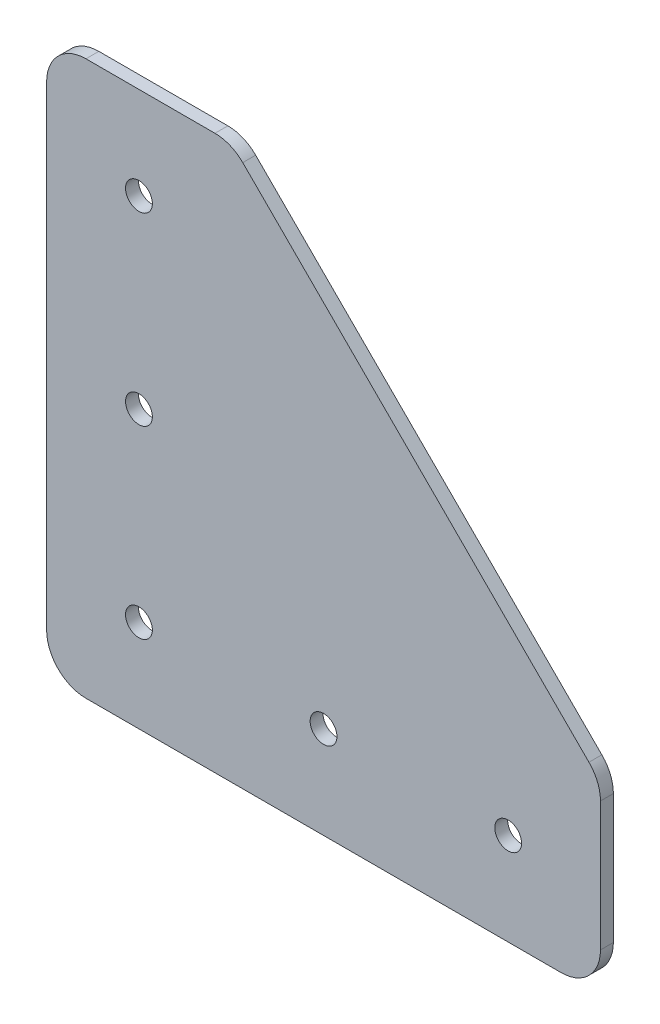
ISO-10303-21;
HEADER;
FILE_DESCRIPTION(('STEP AP214'),'2;1');
FILE_NAME('part.step','',(''),(''),'','','');
FILE_SCHEMA(('AUTOMOTIVE_DESIGN { 1 0 10303 214 1 1 1 1 }'));
ENDSEC;
DATA;
#1=APPLICATION_CONTEXT('core data for automotive mechanical design processes');
#2=APPLICATION_PROTOCOL_DEFINITION('international standard','automotive_design',2000,#1);
#3=PRODUCT_CONTEXT('',#1,'mechanical');
#4=PRODUCT('Part','Part','',(#3));
#5=PRODUCT_RELATED_PRODUCT_CATEGORY('part','',(#4));
#6=PRODUCT_DEFINITION_FORMATION('','',#4);
#7=PRODUCT_DEFINITION_CONTEXT('part definition',#1,'design');
#8=PRODUCT_DEFINITION('design','',#6,#7);
#9=PRODUCT_DEFINITION_SHAPE('','',#8);
#10=(LENGTH_UNIT() NAMED_UNIT(*) SI_UNIT(.MILLI.,.METRE.));
#11=(NAMED_UNIT(*) PLANE_ANGLE_UNIT() SI_UNIT($,.RADIAN.));
#12=(NAMED_UNIT(*) SI_UNIT($,.STERADIAN.) SOLID_ANGLE_UNIT());
#13=UNCERTAINTY_MEASURE_WITH_UNIT(LENGTH_MEASURE(1.E-05),#10,'distance_accuracy_value','');
#14=(GEOMETRIC_REPRESENTATION_CONTEXT(3) GLOBAL_UNCERTAINTY_ASSIGNED_CONTEXT((#13)) GLOBAL_UNIT_ASSIGNED_CONTEXT((#10,
#11,#12)) REPRESENTATION_CONTEXT('',''));
#15=CARTESIAN_POINT('',(0.,0.,0.));
#16=DIRECTION('',(0.,0.,1.));
#17=DIRECTION('',(1.,0.,0.));
#18=AXIS2_PLACEMENT_3D('',#15,#16,#17);
#19=CARTESIAN_POINT('',(0.,0.,0.));
#20=DIRECTION('',(0.,0.,1.));
#21=DIRECTION('',(1.,0.,0.));
#22=AXIS2_PLACEMENT_3D('',#19,#20,#21);
#23=PLANE('',#22);
#24=CARTESIAN_POINT('',(4.841875,4.841875,0.));
#25=DIRECTION('',(0.,0.,-1.));
#26=DIRECTION('',(-1.,0.,0.));
#27=AXIS2_PLACEMENT_3D('',#24,#25,#26);
#28=CIRCLE('',#27,4.841875);
#29=CARTESIAN_POINT('',(0.,4.841875,0.));
#30=VERTEX_POINT('',#29);
#31=CARTESIAN_POINT('',(4.841875,0.,0.));
#32=VERTEX_POINT('',#31);
#33=EDGE_CURVE('E98',#30,#32,#28,.F.);
#34=ORIENTED_EDGE('',*,*,#33,.F.);
#35=DIRECTION('',(0.,1.,0.));
#36=VECTOR('',#35,1.);
#37=CARTESIAN_POINT('',(0.,68.199,0.));
#38=LINE('',#37,#36);
#39=CARTESIAN_POINT('',(0.,63.357125,0.));
#40=VERTEX_POINT('',#39);
#41=EDGE_CURVE('E90',#30,#40,#38,.T.);
#42=ORIENTED_EDGE('',*,*,#41,.T.);
#43=CARTESIAN_POINT('',(4.84187500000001,63.357125,0.));
#44=DIRECTION('',(0.,0.,-1.));
#45=DIRECTION('',(-1.,0.,0.));
#46=AXIS2_PLACEMENT_3D('',#43,#44,#45);
#47=CIRCLE('',#46,4.841875);
#48=CARTESIAN_POINT('',(4.84187500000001,68.199,0.));
#49=VERTEX_POINT('',#48);
#50=EDGE_CURVE('E166',#49,#40,#47,.F.);
#51=ORIENTED_EDGE('',*,*,#50,.F.);
#52=DIRECTION('',(1.,0.,0.));
#53=VECTOR('',#52,1.);
#54=CARTESIAN_POINT('',(22.733,68.199,0.));
#55=LINE('',#54,#53);
#56=CARTESIAN_POINT('',(20.7274297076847,68.199,0.));
#57=VERTEX_POINT('',#56);
#58=EDGE_CURVE('E125',#49,#57,#55,.T.);
#59=ORIENTED_EDGE('',*,*,#58,.T.);
#60=CARTESIAN_POINT('',(20.7274297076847,63.357125,0.));
#61=DIRECTION('',(0.,0.,-1.));
#62=DIRECTION('',(-1.,0.,0.));
#63=AXIS2_PLACEMENT_3D('',#60,#61,#62);
#64=CIRCLE('',#63,4.841875);
#65=CARTESIAN_POINT('',(24.1511523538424,66.7808476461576,0.));
#66=VERTEX_POINT('',#65);
#67=EDGE_CURVE('E128',#66,#57,#64,.F.);
#68=ORIENTED_EDGE('',*,*,#67,.F.);
#69=DIRECTION('',(0.707106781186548,-0.707106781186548,0.));
#70=VECTOR('',#69,1.);
#71=CARTESIAN_POINT('',(68.199,22.733,0.));
#72=LINE('',#71,#70);
#73=CARTESIAN_POINT('',(66.7808476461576,24.1511523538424,0.));
#74=VERTEX_POINT('',#73);
#75=EDGE_CURVE('E129',#66,#74,#72,.T.);
#76=ORIENTED_EDGE('',*,*,#75,.T.);
#77=CARTESIAN_POINT('',(63.357125,20.7274297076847,0.));
#78=DIRECTION('',(0.,0.,-1.));
#79=DIRECTION('',(-1.,0.,0.));
#80=AXIS2_PLACEMENT_3D('',#77,#78,#79);
#81=CIRCLE('',#80,4.841875);
#82=CARTESIAN_POINT('',(68.199,20.7274297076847,0.));
#83=VERTEX_POINT('',#82);
#84=EDGE_CURVE('E132',#83,#74,#81,.F.);
#85=ORIENTED_EDGE('',*,*,#84,.F.);
#86=DIRECTION('',(0.,1.,0.));
#87=VECTOR('',#86,1.);
#88=CARTESIAN_POINT('',(68.199,0.,0.));
#89=LINE('',#88,#87);
#90=CARTESIAN_POINT('',(68.199,4.84187499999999,0.));
#91=VERTEX_POINT('',#90);
#92=EDGE_CURVE('E133',#83,#91,#89,.F.);
#93=ORIENTED_EDGE('',*,*,#92,.T.);
#94=CARTESIAN_POINT('',(63.357125,4.84187499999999,0.));
#95=DIRECTION('',(0.,0.,-1.));
#96=DIRECTION('',(-1.,0.,0.));
#97=AXIS2_PLACEMENT_3D('',#94,#95,#96);
#98=CIRCLE('',#97,4.841875);
#99=CARTESIAN_POINT('',(63.357125,0.,0.));
#100=VERTEX_POINT('',#99);
#101=EDGE_CURVE('E101',#100,#91,#98,.F.);
#102=ORIENTED_EDGE('',*,*,#101,.F.);
#103=DIRECTION('',(-1.,0.,0.));
#104=VECTOR('',#103,1.);
#105=CARTESIAN_POINT('',(0.,0.,0.));
#106=LINE('',#105,#104);
#107=EDGE_CURVE('E95',#100,#32,#106,.T.);
#108=ORIENTED_EDGE('',*,*,#107,.T.);
#109=EDGE_LOOP('',(#34,#42,#51,#59,#68,#76,#85,#93,#102,#108));
#110=FACE_BOUND('',#109,.T.);
#111=CARTESIAN_POINT('',(11.3665,56.8325,0.));
#112=DIRECTION('',(0.,0.,1.));
#113=DIRECTION('',(1.,0.,0.));
#114=AXIS2_PLACEMENT_3D('',#111,#112,#113);
#115=CIRCLE('',#114,1.651);
#116=CARTESIAN_POINT('',(13.0175,56.8325,0.));
#117=VERTEX_POINT('',#116);
#118=EDGE_CURVE('E124',#117,#117,#115,.T.);
#119=ORIENTED_EDGE('',*,*,#118,.T.);
#120=EDGE_LOOP('',(#119));
#121=FACE_BOUND('',#120,.T.);
#122=CARTESIAN_POINT('',(11.3665,34.0995,0.));
#123=DIRECTION('',(0.,0.,1.));
#124=DIRECTION('',(1.,0.,0.));
#125=AXIS2_PLACEMENT_3D('',#122,#123,#124);
#126=CIRCLE('',#125,1.651);
#127=CARTESIAN_POINT('',(13.0175,34.0995,0.));
#128=VERTEX_POINT('',#127);
#129=EDGE_CURVE('E178',#128,#128,#126,.T.);
#130=ORIENTED_EDGE('',*,*,#129,.T.);
#131=EDGE_LOOP('',(#130));
#132=FACE_BOUND('',#131,.T.);
#133=CARTESIAN_POINT('',(11.3665,11.3665,0.));
#134=DIRECTION('',(0.,0.,1.));
#135=DIRECTION('',(1.,0.,0.));
#136=AXIS2_PLACEMENT_3D('',#133,#134,#135);
#137=CIRCLE('',#136,1.651);
#138=CARTESIAN_POINT('',(13.0175,11.3665,0.));
#139=VERTEX_POINT('',#138);
#140=EDGE_CURVE('E181',#139,#139,#137,.T.);
#141=ORIENTED_EDGE('',*,*,#140,.T.);
#142=EDGE_LOOP('',(#141));
#143=FACE_BOUND('',#142,.T.);
#144=CARTESIAN_POINT('',(34.0995,11.3665,0.));
#145=DIRECTION('',(0.,0.,1.));
#146=DIRECTION('',(1.,0.,0.));
#147=AXIS2_PLACEMENT_3D('',#144,#145,#146);
#148=CIRCLE('',#147,1.651);
#149=CARTESIAN_POINT('',(35.7505,11.3665,0.));
#150=VERTEX_POINT('',#149);
#151=EDGE_CURVE('E183',#150,#150,#148,.T.);
#152=ORIENTED_EDGE('',*,*,#151,.T.);
#153=EDGE_LOOP('',(#152));
#154=FACE_BOUND('',#153,.T.);
#155=CARTESIAN_POINT('',(56.8325,11.3665,0.));
#156=DIRECTION('',(0.,0.,1.));
#157=DIRECTION('',(1.,0.,0.));
#158=AXIS2_PLACEMENT_3D('',#155,#156,#157);
#159=CIRCLE('',#158,1.651);
#160=CARTESIAN_POINT('',(58.4835,11.3665,0.));
#161=VERTEX_POINT('',#160);
#162=EDGE_CURVE('E20',#161,#161,#159,.T.);
#163=ORIENTED_EDGE('',*,*,#162,.T.);
#164=EDGE_LOOP('',(#163));
#165=FACE_BOUND('',#164,.T.);
#166=ADVANCED_FACE('F17',(#110,#121,#132,#143,#154,#165),#23,.F.);
#167=CARTESIAN_POINT('',(56.8325,11.3665,1.5875));
#168=DIRECTION('',(0.,0.,1.));
#169=DIRECTION('',(1.,0.,0.));
#170=AXIS2_PLACEMENT_3D('',#167,#168,#169);
#171=CYLINDRICAL_SURFACE('',#170,1.651);
#172=CARTESIAN_POINT('',(56.8325,11.3665,1.5875));
#173=DIRECTION('',(0.,0.,1.));
#174=DIRECTION('',(1.,0.,0.));
#175=AXIS2_PLACEMENT_3D('',#172,#173,#174);
#176=CIRCLE('',#175,1.651);
#177=CARTESIAN_POINT('',(58.4835,11.3665,1.5875));
#178=VERTEX_POINT('',#177);
#179=EDGE_CURVE('E162',#178,#178,#176,.F.);
#180=ORIENTED_EDGE('',*,*,#179,.F.);
#181=EDGE_LOOP('',(#180));
#182=FACE_BOUND('',#181,.T.);
#183=ORIENTED_EDGE('',*,*,#162,.F.);
#184=EDGE_LOOP('',(#183));
#185=FACE_BOUND('',#184,.T.);
#186=ADVANCED_FACE('F191',(#182,#185),#171,.F.);
#187=CARTESIAN_POINT('',(34.0995,11.3665,1.5875));
#188=DIRECTION('',(0.,0.,1.));
#189=DIRECTION('',(1.,0.,0.));
#190=AXIS2_PLACEMENT_3D('',#187,#188,#189);
#191=CYLINDRICAL_SURFACE('',#190,1.651);
#192=CARTESIAN_POINT('',(34.0995,11.3665,1.5875));
#193=DIRECTION('',(0.,0.,1.));
#194=DIRECTION('',(1.,0.,0.));
#195=AXIS2_PLACEMENT_3D('',#192,#193,#194);
#196=CIRCLE('',#195,1.651);
#197=CARTESIAN_POINT('',(35.7505,11.3665,1.5875));
#198=VERTEX_POINT('',#197);
#199=EDGE_CURVE('E159',#198,#198,#196,.F.);
#200=ORIENTED_EDGE('',*,*,#199,.F.);
#201=EDGE_LOOP('',(#200));
#202=FACE_BOUND('',#201,.T.);
#203=ORIENTED_EDGE('',*,*,#151,.F.);
#204=EDGE_LOOP('',(#203));
#205=FACE_BOUND('',#204,.T.);
#206=ADVANCED_FACE('F193',(#202,#205),#191,.F.);
#207=CARTESIAN_POINT('',(11.3665,11.3665,1.5875));
#208=DIRECTION('',(0.,0.,1.));
#209=DIRECTION('',(1.,0.,0.));
#210=AXIS2_PLACEMENT_3D('',#207,#208,#209);
#211=CYLINDRICAL_SURFACE('',#210,1.651);
#212=CARTESIAN_POINT('',(11.3665,11.3665,1.5875));
#213=DIRECTION('',(0.,0.,1.));
#214=DIRECTION('',(1.,0.,0.));
#215=AXIS2_PLACEMENT_3D('',#212,#213,#214);
#216=CIRCLE('',#215,1.651);
#217=CARTESIAN_POINT('',(13.0175,11.3665,1.5875));
#218=VERTEX_POINT('',#217);
#219=EDGE_CURVE('E156',#218,#218,#216,.F.);
#220=ORIENTED_EDGE('',*,*,#219,.F.);
#221=EDGE_LOOP('',(#220));
#222=FACE_BOUND('',#221,.T.);
#223=ORIENTED_EDGE('',*,*,#140,.F.);
#224=EDGE_LOOP('',(#223));
#225=FACE_BOUND('',#224,.T.);
#226=ADVANCED_FACE('F200',(#222,#225),#211,.F.);
#227=CARTESIAN_POINT('',(11.3665,34.0995,1.5875));
#228=DIRECTION('',(0.,0.,1.));
#229=DIRECTION('',(1.,0.,0.));
#230=AXIS2_PLACEMENT_3D('',#227,#228,#229);
#231=CYLINDRICAL_SURFACE('',#230,1.651);
#232=CARTESIAN_POINT('',(11.3665,34.0995,1.5875));
#233=DIRECTION('',(0.,0.,1.));
#234=DIRECTION('',(1.,0.,0.));
#235=AXIS2_PLACEMENT_3D('',#232,#233,#234);
#236=CIRCLE('',#235,1.651);
#237=CARTESIAN_POINT('',(13.0175,34.0995,1.5875));
#238=VERTEX_POINT('',#237);
#239=EDGE_CURVE('E153',#238,#238,#236,.F.);
#240=ORIENTED_EDGE('',*,*,#239,.F.);
#241=EDGE_LOOP('',(#240));
#242=FACE_BOUND('',#241,.T.);
#243=ORIENTED_EDGE('',*,*,#129,.F.);
#244=EDGE_LOOP('',(#243));
#245=FACE_BOUND('',#244,.T.);
#246=ADVANCED_FACE('F250',(#242,#245),#231,.F.);
#247=CARTESIAN_POINT('',(11.3665,56.8325,1.5875));
#248=DIRECTION('',(0.,0.,1.));
#249=DIRECTION('',(1.,0.,0.));
#250=AXIS2_PLACEMENT_3D('',#247,#248,#249);
#251=CYLINDRICAL_SURFACE('',#250,1.651);
#252=CARTESIAN_POINT('',(11.3665,56.8325,1.5875));
#253=DIRECTION('',(0.,0.,1.));
#254=DIRECTION('',(1.,0.,0.));
#255=AXIS2_PLACEMENT_3D('',#252,#253,#254);
#256=CIRCLE('',#255,1.651);
#257=CARTESIAN_POINT('',(13.0175,56.8325,1.5875));
#258=VERTEX_POINT('',#257);
#259=EDGE_CURVE('E150',#258,#258,#256,.F.);
#260=ORIENTED_EDGE('',*,*,#259,.F.);
#261=EDGE_LOOP('',(#260));
#262=FACE_BOUND('',#261,.T.);
#263=ORIENTED_EDGE('',*,*,#118,.F.);
#264=EDGE_LOOP('',(#263));
#265=FACE_BOUND('',#264,.T.);
#266=ADVANCED_FACE('F247',(#262,#265),#251,.F.);
#267=CARTESIAN_POINT('',(0.,68.199,1.5875));
#268=DIRECTION('',(1.,0.,0.));
#269=DIRECTION('',(0.,1.,0.));
#270=AXIS2_PLACEMENT_3D('',#267,#268,#269);
#271=PLANE('',#270);
#272=DIRECTION('',(0.,0.,-1.));
#273=VECTOR('',#272,1.);
#274=CARTESIAN_POINT('',(0.,4.841875,1.5875));
#275=LINE('',#274,#273);
#276=CARTESIAN_POINT('',(0.,4.841875,1.5875));
#277=VERTEX_POINT('',#276);
#278=EDGE_CURVE('E111',#277,#30,#275,.T.);
#279=ORIENTED_EDGE('',*,*,#278,.F.);
#280=DIRECTION('',(0.,1.,0.));
#281=VECTOR('',#280,1.);
#282=CARTESIAN_POINT('',(0.,0.,1.5875));
#283=LINE('',#282,#281);
#284=CARTESIAN_POINT('',(0.,63.357125,1.5875));
#285=VERTEX_POINT('',#284);
#286=EDGE_CURVE('E149',#285,#277,#283,.F.);
#287=ORIENTED_EDGE('',*,*,#286,.F.);
#288=DIRECTION('',(0.,0.,-1.));
#289=VECTOR('',#288,1.);
#290=CARTESIAN_POINT('',(0.,63.357125,1.5875));
#291=LINE('',#290,#289);
#292=EDGE_CURVE('E165',#40,#285,#291,.F.);
#293=ORIENTED_EDGE('',*,*,#292,.F.);
#294=ORIENTED_EDGE('',*,*,#41,.F.);
#295=EDGE_LOOP('',(#279,#287,#293,#294));
#296=FACE_BOUND('',#295,.T.);
#297=ADVANCED_FACE('F244',(#296),#271,.F.);
#298=CARTESIAN_POINT('',(4.841875,4.841875,1.5875));
#299=DIRECTION('',(0.,0.,-1.));
#300=DIRECTION('',(-1.,0.,0.));
#301=AXIS2_PLACEMENT_3D('',#298,#299,#300);
#302=CYLINDRICAL_SURFACE('',#301,4.841875);
#303=ORIENTED_EDGE('',*,*,#33,.T.);
#304=DIRECTION('',(0.,0.,1.));
#305=VECTOR('',#304,1.);
#306=CARTESIAN_POINT('',(4.841875,0.,1.5875));
#307=LINE('',#306,#305);
#308=CARTESIAN_POINT('',(4.841875,0.,1.5875));
#309=VERTEX_POINT('',#308);
#310=EDGE_CURVE('E105',#32,#309,#307,.T.);
#311=ORIENTED_EDGE('',*,*,#310,.T.);
#312=CARTESIAN_POINT('',(4.841875,4.841875,1.5875));
#313=DIRECTION('',(0.,0.,-1.));
#314=DIRECTION('',(-1.,0.,0.));
#315=AXIS2_PLACEMENT_3D('',#312,#313,#314);
#316=CIRCLE('',#315,4.841875);
#317=EDGE_CURVE('E147',#277,#309,#316,.F.);
#318=ORIENTED_EDGE('',*,*,#317,.F.);
#319=ORIENTED_EDGE('',*,*,#278,.T.);
#320=EDGE_LOOP('',(#303,#311,#318,#319));
#321=FACE_BOUND('',#320,.T.);
#322=ADVANCED_FACE('F108',(#321),#302,.T.);
#323=CARTESIAN_POINT('',(0.,0.,1.5875));
#324=DIRECTION('',(0.,1.,0.));
#325=DIRECTION('',(-1.,0.,0.));
#326=AXIS2_PLACEMENT_3D('',#323,#324,#325);
#327=PLANE('',#326);
#328=ORIENTED_EDGE('',*,*,#310,.F.);
#329=ORIENTED_EDGE('',*,*,#107,.F.);
#330=DIRECTION('',(0.,0.,-1.));
#331=VECTOR('',#330,1.);
#332=CARTESIAN_POINT('',(63.357125,0.,1.5875));
#333=LINE('',#332,#331);
#334=CARTESIAN_POINT('',(63.357125,0.,1.5875));
#335=VERTEX_POINT('',#334);
#336=EDGE_CURVE('E117',#335,#100,#333,.T.);
#337=ORIENTED_EDGE('',*,*,#336,.F.);
#338=DIRECTION('',(1.,0.,0.));
#339=VECTOR('',#338,1.);
#340=CARTESIAN_POINT('',(0.,0.,1.5875));
#341=LINE('',#340,#339);
#342=EDGE_CURVE('E115',#309,#335,#341,.T.);
#343=ORIENTED_EDGE('',*,*,#342,.F.);
#344=EDGE_LOOP('',(#328,#329,#337,#343));
#345=FACE_BOUND('',#344,.T.);
#346=ADVANCED_FACE('F113',(#345),#327,.F.);
#347=CARTESIAN_POINT('',(63.357125,4.84187499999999,1.5875));
#348=DIRECTION('',(0.,0.,-1.));
#349=DIRECTION('',(-1.,0.,0.));
#350=AXIS2_PLACEMENT_3D('',#347,#348,#349);
#351=CYLINDRICAL_SURFACE('',#350,4.841875);
#352=ORIENTED_EDGE('',*,*,#101,.T.);
#353=DIRECTION('',(0.,0.,1.));
#354=VECTOR('',#353,1.);
#355=CARTESIAN_POINT('',(68.199,4.84187499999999,1.5875));
#356=LINE('',#355,#354);
#357=CARTESIAN_POINT('',(68.199,4.84187499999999,1.5875));
#358=VERTEX_POINT('',#357);
#359=EDGE_CURVE('E134',#91,#358,#356,.T.);
#360=ORIENTED_EDGE('',*,*,#359,.T.);
#361=CARTESIAN_POINT('',(63.357125,4.84187499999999,1.5875));
#362=DIRECTION('',(0.,0.,-1.));
#363=DIRECTION('',(-1.,0.,0.));
#364=AXIS2_PLACEMENT_3D('',#361,#362,#363);
#365=CIRCLE('',#364,4.841875);
#366=EDGE_CURVE('E144',#335,#358,#365,.F.);
#367=ORIENTED_EDGE('',*,*,#366,.F.);
#368=ORIENTED_EDGE('',*,*,#336,.T.);
#369=EDGE_LOOP('',(#352,#360,#367,#368));
#370=FACE_BOUND('',#369,.T.);
#371=ADVANCED_FACE('F235',(#370),#351,.T.);
#372=CARTESIAN_POINT('',(68.199,0.,1.5875));
#373=DIRECTION('',(-1.,0.,0.));
#374=DIRECTION('',(0.,0.,1.));
#375=AXIS2_PLACEMENT_3D('',#372,#373,#374);
#376=PLANE('',#375);
#377=ORIENTED_EDGE('',*,*,#359,.F.);
#378=ORIENTED_EDGE('',*,*,#92,.F.);
#379=DIRECTION('',(0.,0.,-1.));
#380=VECTOR('',#379,1.);
#381=CARTESIAN_POINT('',(68.199,20.7274297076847,1.5875));
#382=LINE('',#381,#380);
#383=CARTESIAN_POINT('',(68.199,20.7274297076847,1.5875));
#384=VERTEX_POINT('',#383);
#385=EDGE_CURVE('E174',#384,#83,#382,.T.);
#386=ORIENTED_EDGE('',*,*,#385,.F.);
#387=DIRECTION('',(0.,1.,0.));
#388=VECTOR('',#387,1.);
#389=CARTESIAN_POINT('',(68.199,0.,1.5875));
#390=LINE('',#389,#388);
#391=EDGE_CURVE('E143',#358,#384,#390,.T.);
#392=ORIENTED_EDGE('',*,*,#391,.F.);
#393=EDGE_LOOP('',(#377,#378,#386,#392));
#394=FACE_BOUND('',#393,.T.);
#395=ADVANCED_FACE('F231',(#394),#376,.F.);
#396=CARTESIAN_POINT('',(63.357125,20.7274297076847,1.5875));
#397=DIRECTION('',(0.,0.,-1.));
#398=DIRECTION('',(-1.,0.,0.));
#399=AXIS2_PLACEMENT_3D('',#396,#397,#398);
#400=CYLINDRICAL_SURFACE('',#399,4.841875);
#401=ORIENTED_EDGE('',*,*,#84,.T.);
#402=DIRECTION('',(0.,0.,1.));
#403=VECTOR('',#402,1.);
#404=CARTESIAN_POINT('',(66.7808476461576,24.1511523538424,1.5875));
#405=LINE('',#404,#403);
#406=CARTESIAN_POINT('',(66.7808476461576,24.1511523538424,1.5875));
#407=VERTEX_POINT('',#406);
#408=EDGE_CURVE('E131',#74,#407,#405,.T.);
#409=ORIENTED_EDGE('',*,*,#408,.T.);
#410=CARTESIAN_POINT('',(63.357125,20.7274297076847,1.5875));
#411=DIRECTION('',(0.,0.,-1.));
#412=DIRECTION('',(-1.,0.,0.));
#413=AXIS2_PLACEMENT_3D('',#410,#411,#412);
#414=CIRCLE('',#413,4.841875);
#415=EDGE_CURVE('E140',#384,#407,#414,.F.);
#416=ORIENTED_EDGE('',*,*,#415,.F.);
#417=ORIENTED_EDGE('',*,*,#385,.T.);
#418=EDGE_LOOP('',(#401,#409,#416,#417));
#419=FACE_BOUND('',#418,.T.);
#420=ADVANCED_FACE('F227',(#419),#400,.T.);
#421=CARTESIAN_POINT('',(68.199,22.733,1.5875));
#422=DIRECTION('',(-0.707106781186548,-0.707106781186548,0.));
#423=DIRECTION('',(0.707106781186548,-0.707106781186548,0.));
#424=AXIS2_PLACEMENT_3D('',#421,#422,#423);
#425=PLANE('',#424);
#426=ORIENTED_EDGE('',*,*,#408,.F.);
#427=ORIENTED_EDGE('',*,*,#75,.F.);
#428=DIRECTION('',(0.,0.,-1.));
#429=VECTOR('',#428,1.);
#430=CARTESIAN_POINT('',(24.1511523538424,66.7808476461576,1.5875));
#431=LINE('',#430,#429);
#432=CARTESIAN_POINT('',(24.1511523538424,66.7808476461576,1.5875));
#433=VERTEX_POINT('',#432);
#434=EDGE_CURVE('E171',#433,#66,#431,.T.);
#435=ORIENTED_EDGE('',*,*,#434,.F.);
#436=DIRECTION('',(-0.707106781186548,0.707106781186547,0.));
#437=VECTOR('',#436,1.);
#438=CARTESIAN_POINT('',(66.7808476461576,24.1511523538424,1.5875));
#439=LINE('',#438,#437);
#440=EDGE_CURVE('E139',#407,#433,#439,.T.);
#441=ORIENTED_EDGE('',*,*,#440,.F.);
#442=EDGE_LOOP('',(#426,#427,#435,#441));
#443=FACE_BOUND('',#442,.T.);
#444=ADVANCED_FACE('F223',(#443),#425,.F.);
#445=CARTESIAN_POINT('',(20.7274297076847,63.357125,1.5875));
#446=DIRECTION('',(0.,0.,-1.));
#447=DIRECTION('',(-1.,0.,0.));
#448=AXIS2_PLACEMENT_3D('',#445,#446,#447);
#449=CYLINDRICAL_SURFACE('',#448,4.841875);
#450=ORIENTED_EDGE('',*,*,#67,.T.);
#451=DIRECTION('',(0.,0.,-1.));
#452=VECTOR('',#451,1.);
#453=CARTESIAN_POINT('',(20.7274297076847,68.199,1.5875));
#454=LINE('',#453,#452);
#455=CARTESIAN_POINT('',(20.7274297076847,68.199,1.5875));
#456=VERTEX_POINT('',#455);
#457=EDGE_CURVE('E127',#57,#456,#454,.F.);
#458=ORIENTED_EDGE('',*,*,#457,.T.);
#459=CARTESIAN_POINT('',(20.7274297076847,63.357125,1.5875));
#460=DIRECTION('',(0.,0.,-1.));
#461=DIRECTION('',(-1.,0.,0.));
#462=AXIS2_PLACEMENT_3D('',#459,#460,#461);
#463=CIRCLE('',#462,4.841875);
#464=EDGE_CURVE('E136',#433,#456,#463,.F.);
#465=ORIENTED_EDGE('',*,*,#464,.F.);
#466=ORIENTED_EDGE('',*,*,#434,.T.);
#467=EDGE_LOOP('',(#450,#458,#465,#466));
#468=FACE_BOUND('',#467,.T.);
#469=ADVANCED_FACE('F220',(#468),#449,.T.);
#470=CARTESIAN_POINT('',(22.733,68.199,1.5875));
#471=DIRECTION('',(0.,-1.,0.));
#472=DIRECTION('',(0.,0.,-1.));
#473=AXIS2_PLACEMENT_3D('',#470,#471,#472);
#474=PLANE('',#473);
#475=ORIENTED_EDGE('',*,*,#457,.F.);
#476=ORIENTED_EDGE('',*,*,#58,.F.);
#477=DIRECTION('',(0.,0.,-1.));
#478=VECTOR('',#477,1.);
#479=CARTESIAN_POINT('',(4.84187500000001,68.199,1.5875));
#480=LINE('',#479,#478);
#481=CARTESIAN_POINT('',(4.84187500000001,68.199,1.5875));
#482=VERTEX_POINT('',#481);
#483=EDGE_CURVE('E35',#482,#49,#480,.T.);
#484=ORIENTED_EDGE('',*,*,#483,.F.);
#485=DIRECTION('',(1.,0.,0.));
#486=VECTOR('',#485,1.);
#487=CARTESIAN_POINT('',(0.,68.199,1.5875));
#488=LINE('',#487,#486);
#489=EDGE_CURVE('E26',#456,#482,#488,.F.);
#490=ORIENTED_EDGE('',*,*,#489,.F.);
#491=EDGE_LOOP('',(#475,#476,#484,#490));
#492=FACE_BOUND('',#491,.T.);
#493=ADVANCED_FACE('F212',(#492),#474,.F.);
#494=CARTESIAN_POINT('',(4.84187500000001,63.357125,1.5875));
#495=DIRECTION('',(0.,0.,-1.));
#496=DIRECTION('',(-1.,0.,0.));
#497=AXIS2_PLACEMENT_3D('',#494,#495,#496);
#498=CYLINDRICAL_SURFACE('',#497,4.841875);
#499=ORIENTED_EDGE('',*,*,#50,.T.);
#500=ORIENTED_EDGE('',*,*,#292,.T.);
#501=CARTESIAN_POINT('',(4.84187500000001,63.357125,1.5875));
#502=DIRECTION('',(0.,0.,-1.));
#503=DIRECTION('',(-1.,0.,0.));
#504=AXIS2_PLACEMENT_3D('',#501,#502,#503);
#505=CIRCLE('',#504,4.841875);
#506=EDGE_CURVE('E10',#482,#285,#505,.F.);
#507=ORIENTED_EDGE('',*,*,#506,.F.);
#508=ORIENTED_EDGE('',*,*,#483,.T.);
#509=EDGE_LOOP('',(#499,#500,#507,#508));
#510=FACE_BOUND('',#509,.T.);
#511=ADVANCED_FACE('F206',(#510),#498,.T.);
#512=CARTESIAN_POINT('',(0.,0.,1.5875));
#513=DIRECTION('',(0.,0.,1.));
#514=DIRECTION('',(1.,0.,0.));
#515=AXIS2_PLACEMENT_3D('',#512,#513,#514);
#516=PLANE('',#515);
#517=ORIENTED_EDGE('',*,*,#489,.T.);
#518=ORIENTED_EDGE('',*,*,#506,.T.);
#519=ORIENTED_EDGE('',*,*,#286,.T.);
#520=ORIENTED_EDGE('',*,*,#317,.T.);
#521=ORIENTED_EDGE('',*,*,#342,.T.);
#522=ORIENTED_EDGE('',*,*,#366,.T.);
#523=ORIENTED_EDGE('',*,*,#391,.T.);
#524=ORIENTED_EDGE('',*,*,#415,.T.);
#525=ORIENTED_EDGE('',*,*,#440,.T.);
#526=ORIENTED_EDGE('',*,*,#464,.T.);
#527=EDGE_LOOP('',(#517,#518,#519,#520,#521,#522,#523,#524,#525,#526));
#528=FACE_BOUND('',#527,.T.);
#529=ORIENTED_EDGE('',*,*,#259,.T.);
#530=EDGE_LOOP('',(#529));
#531=FACE_BOUND('',#530,.T.);
#532=ORIENTED_EDGE('',*,*,#239,.T.);
#533=EDGE_LOOP('',(#532));
#534=FACE_BOUND('',#533,.T.);
#535=ORIENTED_EDGE('',*,*,#219,.T.);
#536=EDGE_LOOP('',(#535));
#537=FACE_BOUND('',#536,.T.);
#538=ORIENTED_EDGE('',*,*,#199,.T.);
#539=EDGE_LOOP('',(#538));
#540=FACE_BOUND('',#539,.T.);
#541=ORIENTED_EDGE('',*,*,#179,.T.);
#542=EDGE_LOOP('',(#541));
#543=FACE_BOUND('',#542,.T.);
#544=ADVANCED_FACE('F204',(#528,#531,#534,#537,#540,#543),#516,.T.);
#545=CLOSED_SHELL('',(#166,#186,#206,#226,#246,#266,#297,#322,#346,#371,#395,#420,#444,#469,
#493,#511,#544));
#546=MANIFOLD_SOLID_BREP('B1',#545);
#547=ADVANCED_BREP_SHAPE_REPRESENTATION('',(#18,#546),#14);
#548=SHAPE_DEFINITION_REPRESENTATION(#9,#547);
ENDSEC;
END-ISO-10303-21;
